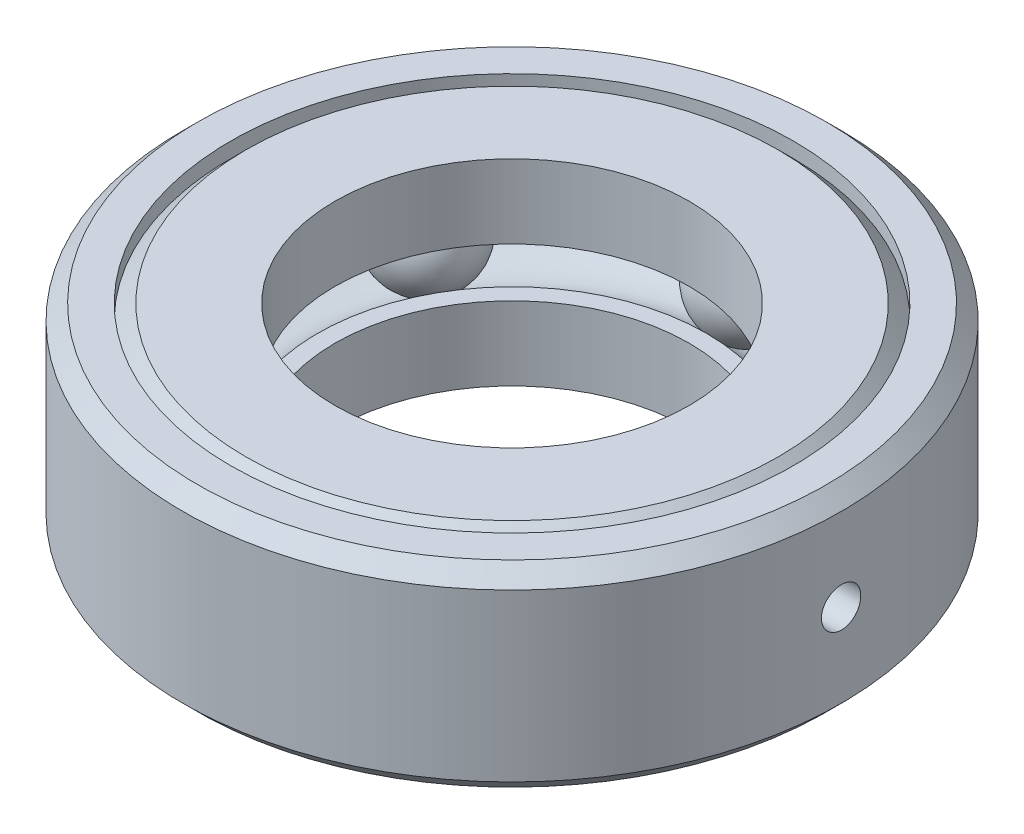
ISO-10303-21;
HEADER;
FILE_DESCRIPTION(('STEP AP214'),'2;1');
FILE_NAME('part.step','',(''),(''),'','','');
FILE_SCHEMA(('AUTOMOTIVE_DESIGN { 1 0 10303 214 1 1 1 1 }'));
ENDSEC;
DATA;
#1=APPLICATION_CONTEXT('core data for automotive mechanical design processes');
#2=APPLICATION_PROTOCOL_DEFINITION('international standard','automotive_design',2000,#1);
#3=PRODUCT_CONTEXT('',#1,'mechanical');
#4=PRODUCT('Part','Part','',(#3));
#5=PRODUCT_RELATED_PRODUCT_CATEGORY('part','',(#4));
#6=PRODUCT_DEFINITION_FORMATION('','',#4);
#7=PRODUCT_DEFINITION_CONTEXT('part definition',#1,'design');
#8=PRODUCT_DEFINITION('design','',#6,#7);
#9=PRODUCT_DEFINITION_SHAPE('','',#8);
#10=(LENGTH_UNIT() NAMED_UNIT(*) SI_UNIT(.MILLI.,.METRE.));
#11=(NAMED_UNIT(*) PLANE_ANGLE_UNIT() SI_UNIT($,.RADIAN.));
#12=(NAMED_UNIT(*) SI_UNIT($,.STERADIAN.) SOLID_ANGLE_UNIT());
#13=UNCERTAINTY_MEASURE_WITH_UNIT(LENGTH_MEASURE(1.E-05),#10,'distance_accuracy_value','');
#14=(GEOMETRIC_REPRESENTATION_CONTEXT(3) GLOBAL_UNCERTAINTY_ASSIGNED_CONTEXT((#13)) GLOBAL_UNIT_ASSIGNED_CONTEXT((#10,
#11,#12)) REPRESENTATION_CONTEXT('',''));
#15=CARTESIAN_POINT('',(0.,0.,0.));
#16=DIRECTION('',(0.,0.,1.));
#17=DIRECTION('',(1.,0.,0.));
#18=AXIS2_PLACEMENT_3D('',#15,#16,#17);
#19=CARTESIAN_POINT('',(0.,-7.9375,0.));
#20=DIRECTION('',(0.,-1.,0.));
#21=DIRECTION('',(0.,0.,-1.));
#22=AXIS2_PLACEMENT_3D('',#19,#20,#21);
#23=CYLINDRICAL_SURFACE('',#22,26.590625);
#24=CARTESIAN_POINT('',(0.,-6.70456744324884,0.));
#25=DIRECTION('',(0.,-1.,0.));
#26=DIRECTION('',(0.,0.,-1.));
#27=AXIS2_PLACEMENT_3D('',#24,#25,#26);
#28=CIRCLE('',#27,26.590625);
#29=CARTESIAN_POINT('',(0.,-6.70456744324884,-26.590625));
#30=VERTEX_POINT('',#29);
#31=EDGE_CURVE('E11',#30,#30,#28,.T.);
#32=ORIENTED_EDGE('',*,*,#31,.F.);
#33=EDGE_LOOP('',(#32));
#34=FACE_BOUND('',#33,.T.);
#35=CARTESIAN_POINT('',(0.,6.70456744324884,0.));
#36=DIRECTION('',(0.,-1.,0.));
#37=DIRECTION('',(0.,0.,-1.));
#38=AXIS2_PLACEMENT_3D('',#35,#36,#37);
#39=CIRCLE('',#38,26.590625);
#40=CARTESIAN_POINT('',(0.,6.70456744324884,-26.590625));
#41=VERTEX_POINT('',#40);
#42=EDGE_CURVE('E83',#41,#41,#39,.T.);
#43=ORIENTED_EDGE('',*,*,#42,.T.);
#44=EDGE_LOOP('',(#43));
#45=FACE_BOUND('',#44,.T.);
#46=CARTESIAN_POINT('',(26.590625,-1.5875,0.));
#47=CARTESIAN_POINT('',(26.5906243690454,-1.58749607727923,-0.0890854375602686));
#48=CARTESIAN_POINT('',(26.5901725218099,-1.57997601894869,-0.178233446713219));
#49=CARTESIAN_POINT('',(26.5884134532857,-1.55008463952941,-0.354068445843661));
#50=CARTESIAN_POINT('',(26.5871052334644,-1.5276959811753,-0.440752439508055));
#51=CARTESIAN_POINT('',(26.5837814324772,-1.46871224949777,-0.60908693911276));
#52=CARTESIAN_POINT('',(26.5817662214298,-1.43212460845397,-0.690740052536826));
#53=CARTESIAN_POINT('',(26.5772551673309,-1.34579339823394,-0.846724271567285));
#54=CARTESIAN_POINT('',(26.5747594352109,-1.29605286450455,-0.921057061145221));
#55=CARTESIAN_POINT('',(26.5695640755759,-1.18475241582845,-1.0604146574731));
#56=CARTESIAN_POINT('',(26.5668642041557,-1.12317822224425,-1.12542805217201));
#57=CARTESIAN_POINT('',(26.5615669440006,-0.989987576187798,-1.24420384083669));
#58=CARTESIAN_POINT('',(26.5589695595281,-0.918370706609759,-1.29796576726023));
#59=CARTESIAN_POINT('',(26.5541683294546,-0.767063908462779,-1.39274699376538));
#60=CARTESIAN_POINT('',(26.5519647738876,-0.687368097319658,-1.43375691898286));
#61=CARTESIAN_POINT('',(26.5482028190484,-0.522206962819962,-1.50181000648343));
#62=CARTESIAN_POINT('',(26.5466444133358,-0.436741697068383,-1.52885330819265));
#63=CARTESIAN_POINT('',(26.5443508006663,-0.262576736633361,-1.56817409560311));
#64=CARTESIAN_POINT('',(26.5436146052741,-0.173881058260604,-1.58046931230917));
#65=CARTESIAN_POINT('',(26.543045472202,0.00431807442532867,-1.58999964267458));
#66=CARTESIAN_POINT('',(26.5432125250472,0.0938215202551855,-1.58723491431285));
#67=CARTESIAN_POINT('',(26.5444301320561,0.270974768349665,-1.56673856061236));
#68=CARTESIAN_POINT('',(26.5454795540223,0.35862679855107,-1.54902611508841));
#69=CARTESIAN_POINT('',(26.5483418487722,0.529711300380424,-1.49916686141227));
#70=CARTESIAN_POINT('',(26.5501547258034,0.613143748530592,-1.46701997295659));
#71=CARTESIAN_POINT('',(26.5543409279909,0.773482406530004,-1.38918256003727));
#72=CARTESIAN_POINT('',(26.5567146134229,0.850384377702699,-1.34348332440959));
#73=CARTESIAN_POINT('',(26.5617545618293,0.995432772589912,-1.23984477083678));
#74=CARTESIAN_POINT('',(26.5644208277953,1.06357910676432,-1.18190532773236));
#75=CARTESIAN_POINT('',(26.5697504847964,1.18929340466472,-1.05532297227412));
#76=CARTESIAN_POINT('',(26.5724138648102,1.24684465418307,-0.986663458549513));
#77=CARTESIAN_POINT('',(26.5774335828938,1.34960622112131,-0.840648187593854));
#78=CARTESIAN_POINT('',(26.5797899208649,1.39481653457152,-0.763292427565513));
#79=CARTESIAN_POINT('',(26.5839301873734,1.47161141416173,-0.602070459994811));
#80=CARTESIAN_POINT('',(26.5857140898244,1.50319535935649,-0.518203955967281));
#81=CARTESIAN_POINT('',(26.5885081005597,1.55182984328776,-0.346345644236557));
#82=CARTESIAN_POINT('',(26.5895182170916,1.56888053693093,-0.258353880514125));
#83=CARTESIAN_POINT('',(26.5906497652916,1.58794382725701,-0.0808878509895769));
#84=CARTESIAN_POINT('',(26.5907725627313,1.58997953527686,0.00858392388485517));
#85=CARTESIAN_POINT('',(26.5901192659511,1.57901543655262,0.186597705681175));
#86=CARTESIAN_POINT('',(26.5893431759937,1.56601570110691,0.275139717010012));
#87=CARTESIAN_POINT('',(26.5869803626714,1.52536886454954,0.448715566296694));
#88=CARTESIAN_POINT('',(26.5853942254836,1.4977323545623,0.533751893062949));
#89=CARTESIAN_POINT('',(26.581589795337,1.42860722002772,0.697979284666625));
#90=CARTESIAN_POINT('',(26.5793714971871,1.38711848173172,0.777170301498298));
#91=CARTESIAN_POINT('',(26.5745486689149,1.29140768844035,0.927565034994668));
#92=CARTESIAN_POINT('',(26.5719436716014,1.23717018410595,0.998758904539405));
#93=CARTESIAN_POINT('',(26.5666422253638,1.11752397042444,1.13103931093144));
#94=CARTESIAN_POINT('',(26.5639457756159,1.05211516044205,1.19212575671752));
#95=CARTESIAN_POINT('',(26.558761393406,0.91188341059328,1.30253546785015));
#96=CARTESIAN_POINT('',(26.556273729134,0.837048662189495,1.35184374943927));
#97=CARTESIAN_POINT('',(26.5517917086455,0.680148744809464,1.43719497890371));
#98=CARTESIAN_POINT('',(26.5497973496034,0.598083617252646,1.47323800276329));
#99=CARTESIAN_POINT('',(26.5465287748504,0.429107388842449,1.53100959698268));
#100=CARTESIAN_POINT('',(26.5452540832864,0.342199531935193,1.55274762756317));
#101=CARTESIAN_POINT('',(26.5435672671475,0.165959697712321,1.5813230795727));
#102=CARTESIAN_POINT('',(26.543155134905,0.0766277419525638,1.58816063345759));
#103=CARTESIAN_POINT('',(26.543240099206,-0.101775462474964,1.5867397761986));
#104=CARTESIAN_POINT('',(26.5437357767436,-0.190846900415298,1.5785049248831));
#105=CARTESIAN_POINT('',(26.5455774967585,-0.366340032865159,1.54722182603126));
#106=CARTESIAN_POINT('',(26.546923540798,-0.45276172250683,1.52417355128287));
#107=CARTESIAN_POINT('',(26.5503139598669,-0.620506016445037,1.46392306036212));
#108=CARTESIAN_POINT('',(26.5523583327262,-0.701828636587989,1.42672088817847));
#109=CARTESIAN_POINT('',(26.556914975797,-0.857076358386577,1.33922202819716));
#110=CARTESIAN_POINT('',(26.559427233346,-0.931001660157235,1.28892569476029));
#111=CARTESIAN_POINT('',(26.5646410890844,-1.06947543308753,1.17657961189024));
#112=CARTESIAN_POINT('',(26.567342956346,-1.13401016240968,1.1145129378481));
#113=CARTESIAN_POINT('',(26.5726293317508,-1.25176606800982,0.98040872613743));
#114=CARTESIAN_POINT('',(26.5752138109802,-1.30498446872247,0.908368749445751));
#115=CARTESIAN_POINT('',(26.5799766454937,-1.39863272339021,0.756287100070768));
#116=CARTESIAN_POINT('',(26.5821545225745,-1.43904755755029,0.676236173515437));
#117=CARTESIAN_POINT('',(26.5858521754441,-1.50581400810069,0.510530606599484));
#118=CARTESIAN_POINT('',(26.5873727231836,-1.53218212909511,0.424882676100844));
#119=CARTESIAN_POINT('',(26.5891850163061,-1.56323802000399,0.282257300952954));
#120=CARTESIAN_POINT('',(26.5897226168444,-1.57232453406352,0.226202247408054));
#121=CARTESIAN_POINT('',(26.5904428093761,-1.58445676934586,0.113439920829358));
#122=CARTESIAN_POINT('',(26.5906254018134,-1.58750249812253,0.0567326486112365));
#123=CARTESIAN_POINT('',(26.590625,-1.5875,0.));
#124=B_SPLINE_CURVE_WITH_KNOTS('',3,(#46,#47,#48,#49,#50,#51,#52,#53,#54,#55,#56,#57,#58,#59,
#60,#61,#62,#63,#64,#65,#66,#67,#68,#69,#70,#71,#72,#73,#74,#75,#76,#77,#78,#79,#80,#81,#82,#83,
#84,#85,#86,#87,#88,#89,#90,#91,#92,#93,#94,#95,#96,#97,#98,#99,#100,#101,#102,#103,#104,#105,
#106,#107,#108,#109,#110,#111,#112,#113,#114,#115,#116,#117,#118,#119,#120,#121,#122,#123),
.UNSPECIFIED.,.T.,.F.,(4,2,2,2,2,2,2,2,2,2,2,2,2,2,2,2,2,2,2,2,2,2,2,2,2,2,2,2,2,2,2,2,2,2,2,2,
2,2,4),(0.,0.267049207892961,0.534410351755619,0.801631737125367,1.06879150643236,
1.33627568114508,1.60377096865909,1.8714624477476,2.13915125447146,2.40651790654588,
2.67388175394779,2.94090306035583,3.20792585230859,3.47512065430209,3.74231818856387,
4.00993369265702,4.27754928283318,4.54517706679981,4.81280199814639,5.08001491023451,
5.34722655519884,5.61424511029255,5.88126585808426,6.14861187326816,6.41596029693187,
6.68364704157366,6.95133225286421,7.21884025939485,7.48634588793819,7.75343373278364,
8.02052206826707,8.28760957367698,8.5546898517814,8.82215711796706,9.08968991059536,
9.35753539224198,9.62506546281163,9.79513172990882,9.96519778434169),.UNSPECIFIED.);
#125=CARTESIAN_POINT('',(26.590625,-1.5875,0.));
#126=VERTEX_POINT('',#125);
#127=EDGE_CURVE('E86',#126,#126,#124,.T.);
#128=ORIENTED_EDGE('',*,*,#127,.F.);
#129=EDGE_LOOP('',(#128));
#130=FACE_BOUND('',#129,.T.);
#131=ADVANCED_FACE('F44',(#34,#45,#130),#23,.T.);
#132=CARTESIAN_POINT('',(0.,-7.9375,0.));
#133=DIRECTION('',(0.,-1.,0.));
#134=DIRECTION('',(0.,0.,-1.));
#135=AXIS2_PLACEMENT_3D('',#132,#133,#134);
#136=CYLINDRICAL_SURFACE('',#135,23.9315625);
#137=CARTESIAN_POINT('',(0.,-5.47163488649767,0.));
#138=DIRECTION('',(0.,-1.,0.));
#139=DIRECTION('',(0.,0.,-1.));
#140=AXIS2_PLACEMENT_3D('',#137,#138,#139);
#141=CIRCLE('',#140,23.9315625);
#142=CARTESIAN_POINT('',(0.,-5.47163488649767,-23.9315625));
#143=VERTEX_POINT('',#142);
#144=EDGE_CURVE('E68',#143,#143,#141,.T.);
#145=ORIENTED_EDGE('',*,*,#144,.T.);
#146=EDGE_LOOP('',(#145));
#147=FACE_BOUND('',#146,.T.);
#148=CARTESIAN_POINT('',(0.,5.47163488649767,0.));
#149=DIRECTION('',(0.,-1.,0.));
#150=DIRECTION('',(0.,0.,-1.));
#151=AXIS2_PLACEMENT_3D('',#148,#149,#150);
#152=CIRCLE('',#151,23.9315625);
#153=CARTESIAN_POINT('',(0.,5.47163488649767,-23.9315625));
#154=VERTEX_POINT('',#153);
#155=EDGE_CURVE('E71',#154,#154,#152,.T.);
#156=ORIENTED_EDGE('',*,*,#155,.F.);
#157=EDGE_LOOP('',(#156));
#158=FACE_BOUND('',#157,.T.);
#159=CARTESIAN_POINT('',(23.8788510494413,0.,1.5875));
#160=CARTESIAN_POINT('',(23.8788517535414,0.0890652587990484,1.58749608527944));
#161=CARTESIAN_POINT('',(23.8793547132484,0.178192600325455,1.57997941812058));
#162=CARTESIAN_POINT('',(23.881312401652,0.353985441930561,1.55010229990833));
#163=CARTESIAN_POINT('',(23.8827682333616,0.440647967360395,1.52772464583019));
#164=CARTESIAN_POINT('',(23.8864660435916,0.608939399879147,1.46877186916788));
#165=CARTESIAN_POINT('',(23.8887076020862,0.690570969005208,1.43220433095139));
#166=CARTESIAN_POINT('',(23.8937237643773,0.846516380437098,1.34592228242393));
#167=CARTESIAN_POINT('',(23.8964982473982,0.920831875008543,1.29621074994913));
#168=CARTESIAN_POINT('',(23.9022728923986,1.06018118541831,1.18496080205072));
#169=CARTESIAN_POINT('',(23.9052733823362,1.12520110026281,1.1234049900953));
#170=CARTESIAN_POINT('',(23.9111589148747,1.24399451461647,0.990249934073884));
#171=CARTESIAN_POINT('',(23.9140439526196,1.29776754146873,0.918650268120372));
#172=CARTESIAN_POINT('',(23.9193763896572,1.39258408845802,0.767360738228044));
#173=CARTESIAN_POINT('',(23.9218233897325,1.43361602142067,0.687663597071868));
#174=CARTESIAN_POINT('',(23.9260005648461,1.50171145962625,0.522492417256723));
#175=CARTESIAN_POINT('',(23.9277307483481,1.52877512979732,0.437018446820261));
#176=CARTESIAN_POINT('',(23.9302770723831,1.56812699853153,0.26285455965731));
#177=CARTESIAN_POINT('',(23.931094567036,1.58043708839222,0.174169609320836));
#178=CARTESIAN_POINT('',(23.9317279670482,1.58999997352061,-0.00401134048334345));
#179=CARTESIAN_POINT('',(23.9315438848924,1.58725295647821,-0.0935073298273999));
#180=CARTESIAN_POINT('',(23.9301960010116,1.56679763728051,-0.270621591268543));
#181=CARTESIAN_POINT('',(23.9290337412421,1.54911288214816,-0.358242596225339));
#182=CARTESIAN_POINT('',(23.9258621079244,1.49932064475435,-0.529269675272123));
#183=CARTESIAN_POINT('',(23.9238527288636,1.46721306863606,-0.612675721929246));
#184=CARTESIAN_POINT('',(23.9192104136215,1.38946001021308,-0.77298077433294));
#185=CARTESIAN_POINT('',(23.9165769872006,1.34380387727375,-0.849874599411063));
#186=CARTESIAN_POINT('',(23.9109828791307,1.24025746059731,-0.994915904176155));
#187=CARTESIAN_POINT('',(23.9080221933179,1.18236702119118,-1.06306327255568));
#188=CARTESIAN_POINT('',(23.9020999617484,1.05586234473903,-1.18881468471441));
#189=CARTESIAN_POINT('',(23.8991384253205,0.987227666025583,-1.24639816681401));
#190=CARTESIAN_POINT('',(23.8935540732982,0.841254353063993,-1.34922863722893));
#191=CARTESIAN_POINT('',(23.8909312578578,0.763915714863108,-1.39447561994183));
#192=CARTESIAN_POINT('',(23.8863205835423,0.602716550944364,-1.47134734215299));
#193=CARTESIAN_POINT('',(23.8843327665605,0.518855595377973,-1.5029711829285));
#194=CARTESIAN_POINT('',(23.8812177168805,0.346998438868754,-1.5516845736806));
#195=CARTESIAN_POINT('',(23.8800904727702,0.259002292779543,-1.56877431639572));
#196=CARTESIAN_POINT('',(23.8788258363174,0.0815520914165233,-1.58790871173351));
#197=CARTESIAN_POINT('',(23.87868656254,-0.00789886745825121,-1.58998196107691));
#198=CARTESIAN_POINT('',(23.8794086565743,-0.185877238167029,-1.57909926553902));
#199=CARTESIAN_POINT('',(23.8802700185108,-0.274404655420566,-1.56614340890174));
#200=CARTESIAN_POINT('',(23.8828945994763,-0.44794190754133,-1.52559403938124));
#201=CARTESIAN_POINT('',(23.8846570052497,-0.532954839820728,-1.49801372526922));
#202=CARTESIAN_POINT('',(23.8888843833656,-0.697145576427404,-1.42901172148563));
#203=CARTESIAN_POINT('',(23.8913493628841,-0.776323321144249,-1.38758989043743));
#204=CARTESIAN_POINT('',(23.8967086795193,-0.926727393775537,-1.29200770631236));
#205=CARTESIAN_POINT('',(23.8996036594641,-0.997941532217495,-1.23782820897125));
#206=CARTESIAN_POINT('',(23.9054945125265,-1.13027402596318,-1.11829647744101));
#207=CARTESIAN_POINT('',(23.9084903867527,-1.19139227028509,-1.05294412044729));
#208=CARTESIAN_POINT('',(23.9142509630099,-1.30189481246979,-0.912798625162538));
#209=CARTESIAN_POINT('',(23.9170152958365,-1.35126059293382,-0.837990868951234));
#210=CARTESIAN_POINT('',(23.9219960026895,-1.43673012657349,-0.681131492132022));
#211=CARTESIAN_POINT('',(23.9242123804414,-1.47283396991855,-0.599079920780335));
#212=CARTESIAN_POINT('',(23.9278456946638,-1.53072262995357,-0.430129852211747));
#213=CARTESIAN_POINT('',(23.9292632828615,-1.55251912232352,-0.343235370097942));
#214=CARTESIAN_POINT('',(23.9311418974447,-1.58121256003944,-0.167010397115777));
#215=CARTESIAN_POINT('',(23.9316029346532,-1.58810967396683,-0.0776799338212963));
#216=CARTESIAN_POINT('',(23.9315165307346,-1.58680689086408,0.100698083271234));
#217=CARTESIAN_POINT('',(23.9309710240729,-1.57863595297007,0.189745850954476));
#218=CARTESIAN_POINT('',(23.9289367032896,-1.54748910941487,0.365201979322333));
#219=CARTESIAN_POINT('',(23.9274478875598,-1.52451317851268,0.451610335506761));
#220=CARTESIAN_POINT('',(23.9236942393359,-1.46441523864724,0.619338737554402));
#221=CARTESIAN_POINT('',(23.9214294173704,-1.42729342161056,0.700658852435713));
#222=CARTESIAN_POINT('',(23.9163778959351,-1.3399613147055,0.855916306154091));
#223=CARTESIAN_POINT('',(23.9135912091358,-1.28975134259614,0.929853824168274));
#224=CARTESIAN_POINT('',(23.9078029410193,-1.17756069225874,1.06839449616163));
#225=CARTESIAN_POINT('',(23.904800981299,-1.11555895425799,1.13298057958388));
#226=CARTESIAN_POINT('',(23.8989235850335,-0.981575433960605,1.25085086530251));
#227=CARTESIAN_POINT('',(23.8960481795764,-0.909591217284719,1.30413230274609));
#228=CARTESIAN_POINT('',(23.8907451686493,-0.757594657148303,1.39792548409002));
#229=CARTESIAN_POINT('',(23.8883181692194,-0.677571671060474,1.43841999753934));
#230=CARTESIAN_POINT('',(23.8841944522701,-0.511904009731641,1.5053484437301));
#231=CARTESIAN_POINT('',(23.8824968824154,-0.426266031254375,1.53179879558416));
#232=CARTESIAN_POINT('',(23.8804677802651,-0.283422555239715,1.56303574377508));
#233=CARTESIAN_POINT('',(23.8798642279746,-0.227139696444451,1.57219792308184));
#234=CARTESIAN_POINT('',(23.879055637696,-0.11391302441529,1.5844312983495));
#235=CARTESIAN_POINT('',(23.8788505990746,-0.0569692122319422,1.58750250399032));
#236=CARTESIAN_POINT('',(23.8788510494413,0.,1.5875));
#237=B_SPLINE_CURVE_WITH_KNOTS('',3,(#159,#160,#161,#162,#163,#164,#165,#166,#167,#168,#169,
#170,#171,#172,#173,#174,#175,#176,#177,#178,#179,#180,#181,#182,#183,#184,#185,#186,#187,#188,
#189,#190,#191,#192,#193,#194,#195,#196,#197,#198,#199,#200,#201,#202,#203,#204,#205,#206,#207,
#208,#209,#210,#211,#212,#213,#214,#215,#216,#217,#218,#219,#220,#221,#222,#223,#224,#225,#226,
#227,#228,#229,#230,#231,#232,#233,#234,#235,#236),.UNSPECIFIED.,.T.,.F.,(4,2,2,2,2,2,2,2,2,2,2,
2,2,2,2,2,2,2,2,2,2,2,2,2,2,2,2,2,2,2,2,2,2,2,2,2,2,2,4),(0.,0.266987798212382,
0.534285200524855,0.801439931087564,1.06853418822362,1.33602378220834,1.60352461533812,
1.87126801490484,2.13900825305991,2.4063507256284,2.67368986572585,2.9406083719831,
3.20752861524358,3.47465924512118,3.74179327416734,4.00944186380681,4.27709057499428,
4.54475694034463,4.81241975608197,5.07957271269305,5.34672410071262,5.61363479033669,
5.88054820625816,6.14786473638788,6.41518420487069,6.68292211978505,6.95065821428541,
7.2181755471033,7.48568985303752,7.75269056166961,8.01969172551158,8.28668926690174,
8.5536803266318,8.82115278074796,9.08869057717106,9.35658735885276,9.62417024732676,
9.79494512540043,9.96571973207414),.UNSPECIFIED.);
#238=CARTESIAN_POINT('',(23.8788510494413,0.,1.5875));
#239=VERTEX_POINT('',#238);
#240=EDGE_CURVE('E48',#239,#239,#237,.T.);
#241=ORIENTED_EDGE('',*,*,#240,.F.);
#242=EDGE_LOOP('',(#241));
#243=FACE_BOUND('',#242,.T.);
#244=ADVANCED_FACE('F112',(#147,#158,#243),#136,.F.);
#245=CARTESIAN_POINT('',(0.,-6.70456744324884,0.));
#246=DIRECTION('',(0.,1.,0.));
#247=DIRECTION('',(0.,0.,1.));
#248=AXIS2_PLACEMENT_3D('',#245,#246,#247);
#249=CONICAL_SURFACE('',#248,26.590625,0.785398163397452);
#250=CARTESIAN_POINT('',(0.,-7.9375,0.));
#251=DIRECTION('',(0.,-1.,0.));
#252=DIRECTION('',(0.,0.,-1.));
#253=AXIS2_PLACEMENT_3D('',#250,#251,#252);
#254=CIRCLE('',#253,25.3576924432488);
#255=CARTESIAN_POINT('',(0.,-7.9375,-25.3576924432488));
#256=VERTEX_POINT('',#255);
#257=EDGE_CURVE('E56',#256,#256,#254,.T.);
#258=ORIENTED_EDGE('',*,*,#257,.F.);
#259=EDGE_LOOP('',(#258));
#260=FACE_BOUND('',#259,.T.);
#261=ORIENTED_EDGE('',*,*,#31,.T.);
#262=EDGE_LOOP('',(#261));
#263=FACE_BOUND('',#262,.T.);
#264=ADVANCED_FACE('F116',(#260,#263),#249,.T.);
#265=CARTESIAN_POINT('',(0.,-7.9375,25.3576924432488));
#266=DIRECTION('',(0.,1.,0.));
#267=DIRECTION('',(0.,0.,1.));
#268=AXIS2_PLACEMENT_3D('',#265,#266,#267);
#269=PLANE('',#268);
#270=CARTESIAN_POINT('',(0.,-7.9375,0.));
#271=DIRECTION('',(0.,-1.,0.));
#272=DIRECTION('',(0.,0.,-1.));
#273=AXIS2_PLACEMENT_3D('',#270,#271,#272);
#274=CIRCLE('',#273,22.6986299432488);
#275=CARTESIAN_POINT('',(0.,-7.9375,-22.6986299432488));
#276=VERTEX_POINT('',#275);
#277=EDGE_CURVE('E60',#276,#276,#274,.T.);
#278=ORIENTED_EDGE('',*,*,#277,.F.);
#279=EDGE_LOOP('',(#278));
#280=FACE_BOUND('',#279,.T.);
#281=ORIENTED_EDGE('',*,*,#257,.T.);
#282=EDGE_LOOP('',(#281));
#283=FACE_BOUND('',#282,.T.);
#284=ADVANCED_FACE('F124',(#280,#283),#269,.F.);
#285=CARTESIAN_POINT('',(0.,-7.9375,0.));
#286=DIRECTION('',(0.,-1.,0.));
#287=DIRECTION('',(0.,0.,-1.));
#288=AXIS2_PLACEMENT_3D('',#285,#286,#287);
#289=CYLINDRICAL_SURFACE('',#288,22.6986299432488);
#290=CARTESIAN_POINT('',(0.,-6.70456744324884,0.));
#291=DIRECTION('',(0.,-1.,0.));
#292=DIRECTION('',(0.,0.,-1.));
#293=AXIS2_PLACEMENT_3D('',#290,#291,#292);
#294=CIRCLE('',#293,22.6986299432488);
#295=CARTESIAN_POINT('',(0.,-6.70456744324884,-22.6986299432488));
#296=VERTEX_POINT('',#295);
#297=EDGE_CURVE('E65',#296,#296,#294,.T.);
#298=ORIENTED_EDGE('',*,*,#297,.F.);
#299=EDGE_LOOP('',(#298));
#300=FACE_BOUND('',#299,.T.);
#301=ORIENTED_EDGE('',*,*,#277,.T.);
#302=EDGE_LOOP('',(#301));
#303=FACE_BOUND('',#302,.T.);
#304=ADVANCED_FACE('F120',(#300,#303),#289,.F.);
#305=CARTESIAN_POINT('',(0.,-6.70456744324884,0.));
#306=DIRECTION('',(0.,1.,0.));
#307=DIRECTION('',(0.,0.,1.));
#308=AXIS2_PLACEMENT_3D('',#305,#306,#307);
#309=CONICAL_SURFACE('',#308,22.6986299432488,0.785398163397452);
#310=ORIENTED_EDGE('',*,*,#144,.F.);
#311=EDGE_LOOP('',(#310));
#312=FACE_BOUND('',#311,.T.);
#313=ORIENTED_EDGE('',*,*,#297,.T.);
#314=EDGE_LOOP('',(#313));
#315=FACE_BOUND('',#314,.T.);
#316=ADVANCED_FACE('F110',(#312,#315),#309,.F.);
#317=CARTESIAN_POINT('',(0.,5.47163488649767,0.));
#318=DIRECTION('',(0.,-1.,0.));
#319=DIRECTION('',(0.,0.,-1.));
#320=AXIS2_PLACEMENT_3D('',#317,#318,#319);
#321=CONICAL_SURFACE('',#320,23.9315625,0.785398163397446);
#322=CARTESIAN_POINT('',(0.,6.70456744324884,0.));
#323=DIRECTION('',(0.,-1.,0.));
#324=DIRECTION('',(0.,0.,-1.));
#325=AXIS2_PLACEMENT_3D('',#322,#323,#324);
#326=CIRCLE('',#325,22.6986299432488);
#327=CARTESIAN_POINT('',(0.,6.70456744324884,-22.6986299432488));
#328=VERTEX_POINT('',#327);
#329=EDGE_CURVE('E74',#328,#328,#326,.T.);
#330=ORIENTED_EDGE('',*,*,#329,.F.);
#331=EDGE_LOOP('',(#330));
#332=FACE_BOUND('',#331,.T.);
#333=ORIENTED_EDGE('',*,*,#155,.T.);
#334=EDGE_LOOP('',(#333));
#335=FACE_BOUND('',#334,.T.);
#336=ADVANCED_FACE('F107',(#332,#335),#321,.F.);
#337=CARTESIAN_POINT('',(0.,-7.9375,0.));
#338=DIRECTION('',(0.,-1.,0.));
#339=DIRECTION('',(0.,0.,-1.));
#340=AXIS2_PLACEMENT_3D('',#337,#338,#339);
#341=CYLINDRICAL_SURFACE('',#340,22.6986299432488);
#342=CARTESIAN_POINT('',(0.,7.9375,0.));
#343=DIRECTION('',(0.,-1.,0.));
#344=DIRECTION('',(0.,0.,-1.));
#345=AXIS2_PLACEMENT_3D('',#342,#343,#344);
#346=CIRCLE('',#345,22.6986299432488);
#347=CARTESIAN_POINT('',(0.,7.9375,-22.6986299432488));
#348=VERTEX_POINT('',#347);
#349=EDGE_CURVE('E77',#348,#348,#346,.T.);
#350=ORIENTED_EDGE('',*,*,#349,.F.);
#351=EDGE_LOOP('',(#350));
#352=FACE_BOUND('',#351,.T.);
#353=ORIENTED_EDGE('',*,*,#329,.T.);
#354=EDGE_LOOP('',(#353));
#355=FACE_BOUND('',#354,.T.);
#356=ADVANCED_FACE('F103',(#352,#355),#341,.F.);
#357=CARTESIAN_POINT('',(0.,7.9375,22.6986299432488));
#358=DIRECTION('',(0.,-1.,0.));
#359=DIRECTION('',(0.,0.,-1.));
#360=AXIS2_PLACEMENT_3D('',#357,#358,#359);
#361=PLANE('',#360);
#362=CARTESIAN_POINT('',(0.,7.9375,0.));
#363=DIRECTION('',(0.,-1.,0.));
#364=DIRECTION('',(0.,0.,-1.));
#365=AXIS2_PLACEMENT_3D('',#362,#363,#364);
#366=CIRCLE('',#365,25.3576924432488);
#367=CARTESIAN_POINT('',(0.,7.9375,-25.3576924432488));
#368=VERTEX_POINT('',#367);
#369=EDGE_CURVE('E80',#368,#368,#366,.T.);
#370=ORIENTED_EDGE('',*,*,#369,.F.);
#371=EDGE_LOOP('',(#370));
#372=FACE_BOUND('',#371,.T.);
#373=ORIENTED_EDGE('',*,*,#349,.T.);
#374=EDGE_LOOP('',(#373));
#375=FACE_BOUND('',#374,.T.);
#376=ADVANCED_FACE('F99',(#372,#375),#361,.F.);
#377=CARTESIAN_POINT('',(0.,7.9375,0.));
#378=DIRECTION('',(0.,-1.,0.));
#379=DIRECTION('',(0.,0.,-1.));
#380=AXIS2_PLACEMENT_3D('',#377,#378,#379);
#381=CONICAL_SURFACE('',#380,25.3576924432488,0.785398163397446);
#382=ORIENTED_EDGE('',*,*,#42,.F.);
#383=EDGE_LOOP('',(#382));
#384=FACE_BOUND('',#383,.T.);
#385=ORIENTED_EDGE('',*,*,#369,.T.);
#386=EDGE_LOOP('',(#385));
#387=FACE_BOUND('',#386,.T.);
#388=ADVANCED_FACE('F94',(#384,#387),#381,.T.);
#389=CARTESIAN_POINT('',(26.590625,0.,0.));
#390=DIRECTION('',(-1.,0.,0.));
#391=DIRECTION('',(0.,0.,1.));
#392=AXIS2_PLACEMENT_3D('',#389,#390,#391);
#393=CYLINDRICAL_SURFACE('',#392,1.5875);
#394=ORIENTED_EDGE('',*,*,#240,.T.);
#395=EDGE_LOOP('',(#394));
#396=FACE_BOUND('',#395,.T.);
#397=ORIENTED_EDGE('',*,*,#127,.T.);
#398=EDGE_LOOP('',(#397));
#399=FACE_BOUND('',#398,.T.);
#400=ADVANCED_FACE('F90',(#396,#399),#393,.F.);
#401=CLOSED_SHELL('',(#131,#244,#264,#284,#304,#316,#336,#356,#376,#388,#400));
#402=MANIFOLD_SOLID_BREP('B2',#401);
#403=CARTESIAN_POINT('',(-16.5493395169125,0.,9.55476562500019));
#404=DIRECTION('',(0.,1.,0.));
#405=DIRECTION('',(0.866025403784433,0.,-0.50000000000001));
#406=AXIS2_PLACEMENT_3D('',#403,#404,#405);
#407=SPHERICAL_SURFACE('',#406,3.96875);
#408=CARTESIAN_POINT('',(-16.5493395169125,3.96875,9.55476562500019));
#409=VERTEX_POINT('',#408);
#410=VERTEX_LOOP('',#409);
#411=FACE_BOUND('',#410,.T.);
#412=ADVANCED_FACE('F257',(#411),#407,.T.);
#413=CLOSED_SHELL('',(#412));
#414=MANIFOLD_SOLID_BREP('B6',#413);
#415=CARTESIAN_POINT('',(-16.5493395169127,0.,-9.55476562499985));
#416=DIRECTION('',(0.,1.,0.));
#417=DIRECTION('',(0.866025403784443,0.,0.499999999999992));
#418=AXIS2_PLACEMENT_3D('',#415,#416,#417);
#419=SPHERICAL_SURFACE('',#418,3.96875);
#420=CARTESIAN_POINT('',(-16.5493395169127,3.96875,-9.55476562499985));
#421=VERTEX_POINT('',#420);
#422=VERTEX_LOOP('',#421);
#423=FACE_BOUND('',#422,.T.);
#424=ADVANCED_FACE('F290',(#423),#419,.T.);
#425=CLOSED_SHELL('',(#424));
#426=MANIFOLD_SOLID_BREP('B40',#425);
#427=CARTESIAN_POINT('',(-1.33441143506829E-13,0.,-19.10953125));
#428=DIRECTION('',(0.,1.,0.));
#429=DIRECTION('',(0.,0.,1.));
#430=AXIS2_PLACEMENT_3D('',#427,#428,#429);
#431=SPHERICAL_SURFACE('',#430,3.96875);
#432=CARTESIAN_POINT('',(-1.33441143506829E-13,3.96875,-19.10953125));
#433=VERTEX_POINT('',#432);
#434=VERTEX_LOOP('',#433);
#435=FACE_BOUND('',#434,.T.);
#436=ADVANCED_FACE('F323',(#435),#431,.T.);
#437=CLOSED_SHELL('',(#436));
#438=MANIFOLD_SOLID_BREP('B253',#437);
#439=CARTESIAN_POINT('',(16.5493395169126,0.,-9.55476562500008));
#440=DIRECTION('',(0.,1.,0.));
#441=DIRECTION('',(-0.866025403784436,0.,0.500000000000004));
#442=AXIS2_PLACEMENT_3D('',#439,#440,#441);
#443=SPHERICAL_SURFACE('',#442,3.96875);
#444=CARTESIAN_POINT('',(16.5493395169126,3.96875,-9.55476562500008));
#445=VERTEX_POINT('',#444);
#446=VERTEX_LOOP('',#445);
#447=FACE_BOUND('',#446,.T.);
#448=ADVANCED_FACE('F356',(#447),#443,.T.);
#449=CLOSED_SHELL('',(#448));
#450=MANIFOLD_SOLID_BREP('B286',#449);
#451=CARTESIAN_POINT('',(16.5493395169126,0.,9.55476562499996));
#452=DIRECTION('',(0.,1.,0.));
#453=DIRECTION('',(-0.86602540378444,0.,-0.499999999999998));
#454=AXIS2_PLACEMENT_3D('',#451,#452,#453);
#455=SPHERICAL_SURFACE('',#454,3.96875);
#456=CARTESIAN_POINT('',(16.5493395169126,3.96875,9.55476562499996));
#457=VERTEX_POINT('',#456);
#458=VERTEX_LOOP('',#457);
#459=FACE_BOUND('',#458,.T.);
#460=ADVANCED_FACE('F389',(#459),#455,.T.);
#461=CLOSED_SHELL('',(#460));
#462=MANIFOLD_SOLID_BREP('B319',#461);
#463=CARTESIAN_POINT('',(0.,0.,19.10953125));
#464=DIRECTION('',(0.,1.,0.));
#465=DIRECTION('',(0.,0.,-1.));
#466=AXIS2_PLACEMENT_3D('',#463,#464,#465);
#467=SPHERICAL_SURFACE('',#466,3.96875);
#468=CARTESIAN_POINT('',(0.,3.96875,19.10953125));
#469=VERTEX_POINT('',#468);
#470=VERTEX_LOOP('',#469);
#471=FACE_BOUND('',#470,.T.);
#472=ADVANCED_FACE('F424',(#471),#467,.T.);
#473=CLOSED_SHELL('',(#472));
#474=MANIFOLD_SOLID_BREP('B352',#473);
#475=CARTESIAN_POINT('',(0.,-7.9375,21.4656973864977));
#476=DIRECTION('',(0.,1.,0.));
#477=DIRECTION('',(0.,0.,1.));
#478=AXIS2_PLACEMENT_3D('',#475,#476,#477);
#479=PLANE('',#478);
#480=CARTESIAN_POINT('',(0.,-7.9375,0.));
#481=DIRECTION('',(0.,-1.,0.));
#482=DIRECTION('',(0.,0.,-1.));
#483=AXIS2_PLACEMENT_3D('',#480,#481,#482);
#484=CIRCLE('',#483,14.2875);
#485=CARTESIAN_POINT('',(0.,-7.9375,-14.2875));
#486=VERTEX_POINT('',#485);
#487=EDGE_CURVE('E469',#486,#486,#484,.T.);
#488=ORIENTED_EDGE('',*,*,#487,.F.);
#489=EDGE_LOOP('',(#488));
#490=FACE_BOUND('',#489,.T.);
#491=CARTESIAN_POINT('',(0.,-7.9375,0.));
#492=DIRECTION('',(0.,-1.,0.));
#493=DIRECTION('',(0.,0.,-1.));
#494=AXIS2_PLACEMENT_3D('',#491,#492,#493);
#495=CIRCLE('',#494,21.4656973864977);
#496=CARTESIAN_POINT('',(0.,-7.9375,-21.4656973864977));
#497=VERTEX_POINT('',#496);
#498=EDGE_CURVE('E423',#497,#497,#495,.T.);
#499=ORIENTED_EDGE('',*,*,#498,.T.);
#500=EDGE_LOOP('',(#499));
#501=FACE_BOUND('',#500,.T.);
#502=ADVANCED_FACE('F444',(#490,#501),#479,.F.);
#503=CARTESIAN_POINT('',(0.,-5.47163488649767,0.));
#504=DIRECTION('',(0.,1.,0.));
#505=DIRECTION('',(0.,0.,1.));
#506=AXIS2_PLACEMENT_3D('',#503,#504,#505);
#507=CONICAL_SURFACE('',#506,23.9315625,0.785398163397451);
#508=ORIENTED_EDGE('',*,*,#498,.F.);
#509=EDGE_LOOP('',(#508));
#510=FACE_BOUND('',#509,.T.);
#511=CARTESIAN_POINT('',(0.,-5.47163488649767,0.));
#512=DIRECTION('',(0.,-1.,0.));
#513=DIRECTION('',(0.,0.,-1.));
#514=AXIS2_PLACEMENT_3D('',#511,#512,#513);
#515=CIRCLE('',#514,23.9315625);
#516=CARTESIAN_POINT('',(0.,-5.47163488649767,-23.9315625));
#517=VERTEX_POINT('',#516);
#518=EDGE_CURVE('E450',#517,#517,#515,.T.);
#519=ORIENTED_EDGE('',*,*,#518,.T.);
#520=EDGE_LOOP('',(#519));
#521=FACE_BOUND('',#520,.T.);
#522=ADVANCED_FACE('F476',(#510,#521),#507,.T.);
#523=CARTESIAN_POINT('',(0.,-7.9375,0.));
#524=DIRECTION('',(0.,-1.,0.));
#525=DIRECTION('',(0.,0.,-1.));
#526=AXIS2_PLACEMENT_3D('',#523,#524,#525);
#527=CYLINDRICAL_SURFACE('',#526,23.9315625);
#528=ORIENTED_EDGE('',*,*,#518,.F.);
#529=EDGE_LOOP('',(#528));
#530=FACE_BOUND('',#529,.T.);
#531=CARTESIAN_POINT('',(0.,-1.984375,0.));
#532=DIRECTION('',(0.,-1.,0.));
#533=DIRECTION('',(0.,0.,-1.));
#534=AXIS2_PLACEMENT_3D('',#531,#532,#533);
#535=CIRCLE('',#534,23.9315625);
#536=CARTESIAN_POINT('',(0.,-1.984375,-23.9315625));
#537=VERTEX_POINT('',#536);
#538=EDGE_CURVE('E454',#537,#537,#535,.T.);
#539=ORIENTED_EDGE('',*,*,#538,.T.);
#540=EDGE_LOOP('',(#539));
#541=FACE_BOUND('',#540,.T.);
#542=ADVANCED_FACE('F480',(#530,#541),#527,.T.);
#543=CARTESIAN_POINT('',(0.,-1.984375,22.5465695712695));
#544=DIRECTION('',(0.,-1.,0.));
#545=DIRECTION('',(0.,0.,-1.));
#546=AXIS2_PLACEMENT_3D('',#543,#544,#545);
#547=PLANE('',#546);
#548=ORIENTED_EDGE('',*,*,#538,.F.);
#549=EDGE_LOOP('',(#548));
#550=FACE_BOUND('',#549,.T.);
#551=CARTESIAN_POINT('',(0.,-1.984375,0.));
#552=DIRECTION('',(0.,-1.,0.));
#553=DIRECTION('',(0.,0.,-1.));
#554=AXIS2_PLACEMENT_3D('',#551,#552,#553);
#555=CIRCLE('',#554,22.5465695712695);
#556=CARTESIAN_POINT('',(0.,-1.984375,-22.5465695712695));
#557=VERTEX_POINT('',#556);
#558=EDGE_CURVE('E458',#557,#557,#555,.T.);
#559=ORIENTED_EDGE('',*,*,#558,.T.);
#560=EDGE_LOOP('',(#559));
#561=FACE_BOUND('',#560,.T.);
#562=ADVANCED_FACE('F485',(#550,#561),#547,.F.);
#563=CARTESIAN_POINT('',(0.,0.,0.));
#564=DIRECTION('',(0.,-1.,0.));
#565=DIRECTION('',(0.,0.,-1.));
#566=AXIS2_PLACEMENT_3D('',#563,#564,#565);
#567=TOROIDAL_SURFACE('',#566,19.10953125,3.96875);
#568=ORIENTED_EDGE('',*,*,#558,.F.);
#569=EDGE_LOOP('',(#568));
#570=FACE_BOUND('',#569,.T.);
#571=CARTESIAN_POINT('',(0.,-1.984375,0.));
#572=DIRECTION('',(0.,-1.,0.));
#573=DIRECTION('',(0.,0.,-1.));
#574=AXIS2_PLACEMENT_3D('',#571,#572,#573);
#575=CIRCLE('',#574,15.6724929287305);
#576=CARTESIAN_POINT('',(0.,-1.984375,-15.6724929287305));
#577=VERTEX_POINT('',#576);
#578=EDGE_CURVE('E463',#577,#577,#575,.T.);
#579=ORIENTED_EDGE('',*,*,#578,.T.);
#580=EDGE_LOOP('',(#579));
#581=FACE_BOUND('',#580,.T.);
#582=ADVANCED_FACE('F491',(#570,#581),#567,.F.);
#583=CARTESIAN_POINT('',(0.,-1.984375,14.2875));
#584=DIRECTION('',(0.,-1.,0.));
#585=DIRECTION('',(0.,0.,-1.));
#586=AXIS2_PLACEMENT_3D('',#583,#584,#585);
#587=PLANE('',#586);
#588=ORIENTED_EDGE('',*,*,#578,.F.);
#589=EDGE_LOOP('',(#588));
#590=FACE_BOUND('',#589,.T.);
#591=CARTESIAN_POINT('',(0.,-1.984375,0.));
#592=DIRECTION('',(0.,-1.,0.));
#593=DIRECTION('',(0.,0.,-1.));
#594=AXIS2_PLACEMENT_3D('',#591,#592,#593);
#595=CIRCLE('',#594,14.2875);
#596=CARTESIAN_POINT('',(0.,-1.984375,-14.2875));
#597=VERTEX_POINT('',#596);
#598=EDGE_CURVE('E466',#597,#597,#595,.T.);
#599=ORIENTED_EDGE('',*,*,#598,.T.);
#600=EDGE_LOOP('',(#599));
#601=FACE_BOUND('',#600,.T.);
#602=ADVANCED_FACE('F495',(#590,#601),#587,.F.);
#603=CARTESIAN_POINT('',(0.,-7.9375,0.));
#604=DIRECTION('',(0.,-1.,0.));
#605=DIRECTION('',(0.,0.,-1.));
#606=AXIS2_PLACEMENT_3D('',#603,#604,#605);
#607=CYLINDRICAL_SURFACE('',#606,14.2875);
#608=ORIENTED_EDGE('',*,*,#598,.F.);
#609=EDGE_LOOP('',(#608));
#610=FACE_BOUND('',#609,.T.);
#611=ORIENTED_EDGE('',*,*,#487,.T.);
#612=EDGE_LOOP('',(#611));
#613=FACE_BOUND('',#612,.T.);
#614=ADVANCED_FACE('F473',(#610,#613),#607,.F.);
#615=CLOSED_SHELL('',(#502,#522,#542,#562,#582,#602,#614));
#616=MANIFOLD_SOLID_BREP('B385',#615);
#617=CARTESIAN_POINT('',(0.,0.,0.));
#618=DIRECTION('',(0.,-1.,0.));
#619=DIRECTION('',(0.,0.,-1.));
#620=AXIS2_PLACEMENT_3D('',#617,#618,#619);
#621=TOROIDAL_SURFACE('',#620,19.10953125,3.96875);
#622=CARTESIAN_POINT('',(0.,1.984375,0.));
#623=DIRECTION('',(0.,-1.,0.));
#624=DIRECTION('',(0.,0.,-1.));
#625=AXIS2_PLACEMENT_3D('',#622,#623,#624);
#626=CIRCLE('',#625,15.6724929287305);
#627=CARTESIAN_POINT('',(0.,1.984375,-15.6724929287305));
#628=VERTEX_POINT('',#627);
#629=EDGE_CURVE('E443',#628,#628,#626,.T.);
#630=ORIENTED_EDGE('',*,*,#629,.F.);
#631=EDGE_LOOP('',(#630));
#632=FACE_BOUND('',#631,.T.);
#633=CARTESIAN_POINT('',(0.,1.984375,0.));
#634=DIRECTION('',(0.,-1.,0.));
#635=DIRECTION('',(0.,0.,-1.));
#636=AXIS2_PLACEMENT_3D('',#633,#634,#635);
#637=CIRCLE('',#636,22.5465695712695);
#638=CARTESIAN_POINT('',(0.,1.984375,-22.5465695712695));
#639=VERTEX_POINT('',#638);
#640=EDGE_CURVE('E598',#639,#639,#637,.T.);
#641=ORIENTED_EDGE('',*,*,#640,.T.);
#642=EDGE_LOOP('',(#641));
#643=FACE_BOUND('',#642,.T.);
#644=ADVANCED_FACE('F573',(#632,#643),#621,.F.);
#645=CARTESIAN_POINT('',(0.,1.984375,14.2875));
#646=DIRECTION('',(0.,1.,0.));
#647=DIRECTION('',(0.,0.,1.));
#648=AXIS2_PLACEMENT_3D('',#645,#646,#647);
#649=PLANE('',#648);
#650=CARTESIAN_POINT('',(0.,1.984375,0.));
#651=DIRECTION('',(0.,-1.,0.));
#652=DIRECTION('',(0.,0.,-1.));
#653=AXIS2_PLACEMENT_3D('',#650,#651,#652);
#654=CIRCLE('',#653,14.2875);
#655=CARTESIAN_POINT('',(0.,1.984375,-14.2875));
#656=VERTEX_POINT('',#655);
#657=EDGE_CURVE('E579',#656,#656,#654,.T.);
#658=ORIENTED_EDGE('',*,*,#657,.F.);
#659=EDGE_LOOP('',(#658));
#660=FACE_BOUND('',#659,.T.);
#661=ORIENTED_EDGE('',*,*,#629,.T.);
#662=EDGE_LOOP('',(#661));
#663=FACE_BOUND('',#662,.T.);
#664=ADVANCED_FACE('F629',(#660,#663),#649,.F.);
#665=CARTESIAN_POINT('',(0.,-7.9375,0.));
#666=DIRECTION('',(0.,-1.,0.));
#667=DIRECTION('',(0.,0.,-1.));
#668=AXIS2_PLACEMENT_3D('',#665,#666,#667);
#669=CYLINDRICAL_SURFACE('',#668,14.2875);
#670=CARTESIAN_POINT('',(0.,7.9375,0.));
#671=DIRECTION('',(0.,-1.,0.));
#672=DIRECTION('',(0.,0.,-1.));
#673=AXIS2_PLACEMENT_3D('',#670,#671,#672);
#674=CIRCLE('',#673,14.2875);
#675=CARTESIAN_POINT('',(0.,7.9375,-14.2875));
#676=VERTEX_POINT('',#675);
#677=EDGE_CURVE('E583',#676,#676,#674,.T.);
#678=ORIENTED_EDGE('',*,*,#677,.F.);
#679=EDGE_LOOP('',(#678));
#680=FACE_BOUND('',#679,.T.);
#681=ORIENTED_EDGE('',*,*,#657,.T.);
#682=EDGE_LOOP('',(#681));
#683=FACE_BOUND('',#682,.T.);
#684=ADVANCED_FACE('F624',(#680,#683),#669,.F.);
#685=CARTESIAN_POINT('',(0.,7.9375,21.4656973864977));
#686=DIRECTION('',(0.,-1.,0.));
#687=DIRECTION('',(0.,0.,-1.));
#688=AXIS2_PLACEMENT_3D('',#685,#686,#687);
#689=PLANE('',#688);
#690=CARTESIAN_POINT('',(0.,7.9375,0.));
#691=DIRECTION('',(0.,-1.,0.));
#692=DIRECTION('',(0.,0.,-1.));
#693=AXIS2_PLACEMENT_3D('',#690,#691,#692);
#694=CIRCLE('',#693,21.4656973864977);
#695=CARTESIAN_POINT('',(0.,7.9375,-21.4656973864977));
#696=VERTEX_POINT('',#695);
#697=EDGE_CURVE('E587',#696,#696,#694,.T.);
#698=ORIENTED_EDGE('',*,*,#697,.F.);
#699=EDGE_LOOP('',(#698));
#700=FACE_BOUND('',#699,.T.);
#701=ORIENTED_EDGE('',*,*,#677,.T.);
#702=EDGE_LOOP('',(#701));
#703=FACE_BOUND('',#702,.T.);
#704=ADVANCED_FACE('F618',(#700,#703),#689,.F.);
#705=CARTESIAN_POINT('',(0.,7.9375,0.));
#706=DIRECTION('',(0.,-1.,0.));
#707=DIRECTION('',(0.,0.,-1.));
#708=AXIS2_PLACEMENT_3D('',#705,#706,#707);
#709=CONICAL_SURFACE('',#708,21.4656973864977,0.78539816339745);
#710=CARTESIAN_POINT('',(0.,5.47163488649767,0.));
#711=DIRECTION('',(0.,-1.,0.));
#712=DIRECTION('',(0.,0.,-1.));
#713=AXIS2_PLACEMENT_3D('',#710,#711,#712);
#714=CIRCLE('',#713,23.9315625);
#715=CARTESIAN_POINT('',(0.,5.47163488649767,-23.9315625));
#716=VERTEX_POINT('',#715);
#717=EDGE_CURVE('E592',#716,#716,#714,.T.);
#718=ORIENTED_EDGE('',*,*,#717,.F.);
#719=EDGE_LOOP('',(#718));
#720=FACE_BOUND('',#719,.T.);
#721=ORIENTED_EDGE('',*,*,#697,.T.);
#722=EDGE_LOOP('',(#721));
#723=FACE_BOUND('',#722,.T.);
#724=ADVANCED_FACE('F612',(#720,#723),#709,.T.);
#725=CARTESIAN_POINT('',(0.,-7.9375,0.));
#726=DIRECTION('',(0.,-1.,0.));
#727=DIRECTION('',(0.,0.,-1.));
#728=AXIS2_PLACEMENT_3D('',#725,#726,#727);
#729=CYLINDRICAL_SURFACE('',#728,23.9315625);
#730=CARTESIAN_POINT('',(0.,1.984375,0.));
#731=DIRECTION('',(0.,-1.,0.));
#732=DIRECTION('',(0.,0.,-1.));
#733=AXIS2_PLACEMENT_3D('',#730,#731,#732);
#734=CIRCLE('',#733,23.9315625);
#735=CARTESIAN_POINT('',(0.,1.984375,-23.9315625));
#736=VERTEX_POINT('',#735);
#737=EDGE_CURVE('E595',#736,#736,#734,.T.);
#738=ORIENTED_EDGE('',*,*,#737,.F.);
#739=EDGE_LOOP('',(#738));
#740=FACE_BOUND('',#739,.T.);
#741=ORIENTED_EDGE('',*,*,#717,.T.);
#742=EDGE_LOOP('',(#741));
#743=FACE_BOUND('',#742,.T.);
#744=ADVANCED_FACE('F606',(#740,#743),#729,.T.);
#745=CARTESIAN_POINT('',(0.,1.984375,22.5465695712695));
#746=DIRECTION('',(0.,1.,0.));
#747=DIRECTION('',(0.,0.,1.));
#748=AXIS2_PLACEMENT_3D('',#745,#746,#747);
#749=PLANE('',#748);
#750=ORIENTED_EDGE('',*,*,#640,.F.);
#751=EDGE_LOOP('',(#750));
#752=FACE_BOUND('',#751,.T.);
#753=ORIENTED_EDGE('',*,*,#737,.T.);
#754=EDGE_LOOP('',(#753));
#755=FACE_BOUND('',#754,.T.);
#756=ADVANCED_FACE('F603',(#752,#755),#749,.F.);
#757=CLOSED_SHELL('',(#644,#664,#684,#704,#724,#744,#756));
#758=MANIFOLD_SOLID_BREP('B418',#757);
#759=ADVANCED_BREP_SHAPE_REPRESENTATION('',(#18,#402,#414,#426,#438,#450,#462,#474,#616,#758),#14);
#760=SHAPE_DEFINITION_REPRESENTATION(#9,#759);
ENDSEC;
END-ISO-10303-21;
